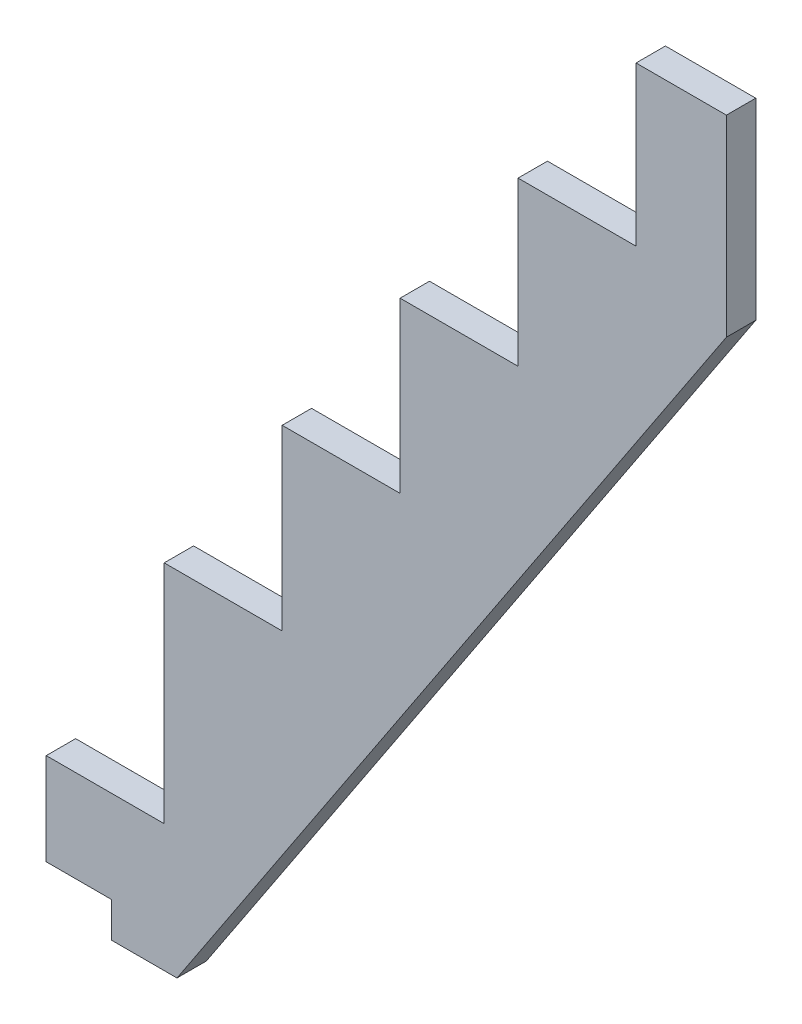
ISO-10303-21;
HEADER;
FILE_DESCRIPTION(('STEP AP214'),'2;1');
FILE_NAME('part.step','',(''),(''),'','','');
FILE_SCHEMA(('AUTOMOTIVE_DESIGN { 1 0 10303 214 1 1 1 1 }'));
ENDSEC;
DATA;
#1=APPLICATION_CONTEXT('core data for automotive mechanical design processes');
#2=APPLICATION_PROTOCOL_DEFINITION('international standard','automotive_design',2000,#1);
#3=PRODUCT_CONTEXT('',#1,'mechanical');
#4=PRODUCT('Part','Part','',(#3));
#5=PRODUCT_RELATED_PRODUCT_CATEGORY('part','',(#4));
#6=PRODUCT_DEFINITION_FORMATION('','',#4);
#7=PRODUCT_DEFINITION_CONTEXT('part definition',#1,'design');
#8=PRODUCT_DEFINITION('design','',#6,#7);
#9=PRODUCT_DEFINITION_SHAPE('','',#8);
#10=(LENGTH_UNIT() NAMED_UNIT(*) SI_UNIT(.MILLI.,.METRE.));
#11=(NAMED_UNIT(*) PLANE_ANGLE_UNIT() SI_UNIT($,.RADIAN.));
#12=(NAMED_UNIT(*) SI_UNIT($,.STERADIAN.) SOLID_ANGLE_UNIT());
#13=UNCERTAINTY_MEASURE_WITH_UNIT(LENGTH_MEASURE(1.E-05),#10,'distance_accuracy_value','');
#14=(GEOMETRIC_REPRESENTATION_CONTEXT(3) GLOBAL_UNCERTAINTY_ASSIGNED_CONTEXT((#13)) GLOBAL_UNIT_ASSIGNED_CONTEXT((#10,
#11,#12)) REPRESENTATION_CONTEXT('',''));
#15=CARTESIAN_POINT('',(0.,0.,0.));
#16=DIRECTION('',(0.,0.,1.));
#17=DIRECTION('',(1.,0.,0.));
#18=AXIS2_PLACEMENT_3D('',#15,#16,#17);
#19=CARTESIAN_POINT('',(-501.90700356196,-2579.9725408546,50.));
#20=DIRECTION('',(0.,1.,0.));
#21=DIRECTION('',(0.,0.,1.));
#22=AXIS2_PLACEMENT_3D('',#19,#20,#21);
#23=PLANE('',#22);
#24=DIRECTION('',(1.,0.,0.));
#25=VECTOR('',#24,1.);
#26=CARTESIAN_POINT('',(-501.90700356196,-2579.9725408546,0.));
#27=LINE('',#26,#25);
#28=CARTESIAN_POINT('',(-613.412502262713,-2579.9725408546,0.));
#29=VERTEX_POINT('',#28);
#30=CARTESIAN_POINT('',(-501.90700356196,-2579.9725408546,0.));
#31=VERTEX_POINT('',#30);
#32=EDGE_CURVE('E152',#29,#31,#27,.T.);
#33=ORIENTED_EDGE('',*,*,#32,.T.);
#34=DIRECTION('',(0.,0.,-1.));
#35=VECTOR('',#34,1.);
#36=CARTESIAN_POINT('',(-501.90700356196,-2579.9725408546,50.));
#37=LINE('',#36,#35);
#38=CARTESIAN_POINT('',(-501.90700356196,-2579.9725408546,50.));
#39=VERTEX_POINT('',#38);
#40=EDGE_CURVE('E11',#39,#31,#37,.T.);
#41=ORIENTED_EDGE('',*,*,#40,.F.);
#42=DIRECTION('',(1.,0.,0.));
#43=VECTOR('',#42,1.);
#44=CARTESIAN_POINT('',(-501.90700356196,-2579.9725408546,50.));
#45=LINE('',#44,#43);
#46=CARTESIAN_POINT('',(-613.412502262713,-2579.9725408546,50.));
#47=VERTEX_POINT('',#46);
#48=EDGE_CURVE('E197',#47,#39,#45,.T.);
#49=ORIENTED_EDGE('',*,*,#48,.F.);
#50=DIRECTION('',(0.,0.,-1.));
#51=VECTOR('',#50,1.);
#52=CARTESIAN_POINT('',(-613.412502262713,-2579.9725408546,50.));
#53=LINE('',#52,#51);
#54=EDGE_CURVE('E165',#47,#29,#53,.T.);
#55=ORIENTED_EDGE('',*,*,#54,.T.);
#56=EDGE_LOOP('',(#33,#41,#49,#55));
#57=FACE_BOUND('',#56,.T.);
#58=ADVANCED_FACE('F30',(#57),#23,.F.);
#59=CARTESIAN_POINT('',(-501.90700356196,-2579.9725408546,50.));
#60=DIRECTION('',(-0.833749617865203,0.552142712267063,0.));
#61=DIRECTION('',(-0.552142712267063,-0.833749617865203,0.));
#62=AXIS2_PLACEMENT_3D('',#59,#60,#61);
#63=PLANE('',#62);
#64=DIRECTION('',(0.552142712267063,0.833749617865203,0.));
#65=VECTOR('',#64,1.);
#66=CARTESIAN_POINT('',(-501.90700356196,-2579.9725408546,0.));
#67=LINE('',#66,#65);
#68=CARTESIAN_POINT('',(433.207497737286,-1167.9257261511,0.));
#69=VERTEX_POINT('',#68);
#70=EDGE_CURVE('E148',#31,#69,#67,.T.);
#71=ORIENTED_EDGE('',*,*,#70,.T.);
#72=DIRECTION('',(0.,0.,-1.));
#73=VECTOR('',#72,1.);
#74=CARTESIAN_POINT('',(433.207497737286,-1167.9257261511,50.));
#75=LINE('',#74,#73);
#76=CARTESIAN_POINT('',(433.207497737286,-1167.9257261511,50.));
#77=VERTEX_POINT('',#76);
#78=EDGE_CURVE('E37',#77,#69,#75,.T.);
#79=ORIENTED_EDGE('',*,*,#78,.F.);
#80=DIRECTION('',(0.552142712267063,0.833749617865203,0.));
#81=VECTOR('',#80,1.);
#82=CARTESIAN_POINT('',(-501.90700356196,-2579.9725408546,50.));
#83=LINE('',#82,#81);
#84=EDGE_CURVE('E161',#39,#77,#83,.T.);
#85=ORIENTED_EDGE('',*,*,#84,.F.);
#86=ORIENTED_EDGE('',*,*,#40,.T.);
#87=EDGE_LOOP('',(#71,#79,#85,#86));
#88=FACE_BOUND('',#87,.T.);
#89=ADVANCED_FACE('F160',(#88),#63,.F.);
#90=CARTESIAN_POINT('',(433.207497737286,-840.511783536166,50.));
#91=DIRECTION('',(-1.,0.,0.));
#92=DIRECTION('',(0.,-1.,0.));
#93=AXIS2_PLACEMENT_3D('',#90,#91,#92);
#94=PLANE('',#93);
#95=DIRECTION('',(0.,1.,0.));
#96=VECTOR('',#95,1.);
#97=CARTESIAN_POINT('',(433.207497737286,-840.511783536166,0.));
#98=LINE('',#97,#96);
#99=CARTESIAN_POINT('',(433.207497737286,-840.511783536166,0.));
#100=VERTEX_POINT('',#99);
#101=EDGE_CURVE('E154',#69,#100,#98,.T.);
#102=ORIENTED_EDGE('',*,*,#101,.T.);
#103=DIRECTION('',(0.,0.,-1.));
#104=VECTOR('',#103,1.);
#105=CARTESIAN_POINT('',(433.207497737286,-840.511783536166,50.));
#106=LINE('',#105,#104);
#107=CARTESIAN_POINT('',(433.207497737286,-840.511783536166,50.));
#108=VERTEX_POINT('',#107);
#109=EDGE_CURVE('E268',#108,#100,#106,.T.);
#110=ORIENTED_EDGE('',*,*,#109,.F.);
#111=DIRECTION('',(0.,1.,0.));
#112=VECTOR('',#111,1.);
#113=CARTESIAN_POINT('',(433.207497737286,-840.511783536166,50.));
#114=LINE('',#113,#112);
#115=EDGE_CURVE('E200',#77,#108,#114,.T.);
#116=ORIENTED_EDGE('',*,*,#115,.F.);
#117=ORIENTED_EDGE('',*,*,#78,.T.);
#118=EDGE_LOOP('',(#102,#110,#116,#117));
#119=FACE_BOUND('',#118,.T.);
#120=ADVANCED_FACE('F272',(#119),#94,.F.);
#121=CARTESIAN_POINT('',(279.437497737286,-840.511783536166,50.));
#122=DIRECTION('',(0.,-1.,0.));
#123=DIRECTION('',(0.,0.,-1.));
#124=AXIS2_PLACEMENT_3D('',#121,#122,#123);
#125=PLANE('',#124);
#126=DIRECTION('',(-1.,0.,0.));
#127=VECTOR('',#126,1.);
#128=CARTESIAN_POINT('',(279.437497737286,-840.511783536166,0.));
#129=LINE('',#128,#127);
#130=CARTESIAN_POINT('',(279.437497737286,-840.511783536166,0.));
#131=VERTEX_POINT('',#130);
#132=EDGE_CURVE('E169',#100,#131,#129,.T.);
#133=ORIENTED_EDGE('',*,*,#132,.T.);
#134=DIRECTION('',(0.,0.,-1.));
#135=VECTOR('',#134,1.);
#136=CARTESIAN_POINT('',(279.437497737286,-840.511783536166,50.));
#137=LINE('',#136,#135);
#138=CARTESIAN_POINT('',(279.437497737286,-840.511783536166,50.));
#139=VERTEX_POINT('',#138);
#140=EDGE_CURVE('E265',#139,#131,#137,.T.);
#141=ORIENTED_EDGE('',*,*,#140,.F.);
#142=DIRECTION('',(-1.,0.,0.));
#143=VECTOR('',#142,1.);
#144=CARTESIAN_POINT('',(279.437497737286,-840.511783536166,50.));
#145=LINE('',#144,#143);
#146=EDGE_CURVE('E202',#108,#139,#145,.T.);
#147=ORIENTED_EDGE('',*,*,#146,.F.);
#148=ORIENTED_EDGE('',*,*,#109,.T.);
#149=EDGE_LOOP('',(#133,#141,#147,#148));
#150=FACE_BOUND('',#149,.T.);
#151=ADVANCED_FACE('F280',(#150),#125,.F.);
#152=CARTESIAN_POINT('',(279.437497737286,-1110.57926459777,50.));
#153=DIRECTION('',(1.,0.,0.));
#154=DIRECTION('',(0.,0.,-1.));
#155=AXIS2_PLACEMENT_3D('',#152,#153,#154);
#156=PLANE('',#155);
#157=DIRECTION('',(0.,-1.,0.));
#158=VECTOR('',#157,1.);
#159=CARTESIAN_POINT('',(279.437497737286,-1110.57926459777,0.));
#160=LINE('',#159,#158);
#161=CARTESIAN_POINT('',(279.437497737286,-1110.57926459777,0.));
#162=VERTEX_POINT('',#161);
#163=EDGE_CURVE('E171',#131,#162,#160,.T.);
#164=ORIENTED_EDGE('',*,*,#163,.T.);
#165=DIRECTION('',(0.,0.,-1.));
#166=VECTOR('',#165,1.);
#167=CARTESIAN_POINT('',(279.437497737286,-1110.57926459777,50.));
#168=LINE('',#167,#166);
#169=CARTESIAN_POINT('',(279.437497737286,-1110.57926459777,50.));
#170=VERTEX_POINT('',#169);
#171=EDGE_CURVE('E262',#170,#162,#168,.T.);
#172=ORIENTED_EDGE('',*,*,#171,.F.);
#173=DIRECTION('',(0.,-1.,0.));
#174=VECTOR('',#173,1.);
#175=CARTESIAN_POINT('',(279.437497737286,-1110.57926459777,50.));
#176=LINE('',#175,#174);
#177=EDGE_CURVE('E204',#139,#170,#176,.T.);
#178=ORIENTED_EDGE('',*,*,#177,.F.);
#179=ORIENTED_EDGE('',*,*,#140,.T.);
#180=EDGE_LOOP('',(#164,#172,#178,#179));
#181=FACE_BOUND('',#180,.T.);
#182=ADVANCED_FACE('F283',(#181),#156,.F.);
#183=CARTESIAN_POINT('',(78.667497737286,-1110.57926459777,50.));
#184=DIRECTION('',(0.,-1.,0.));
#185=DIRECTION('',(0.,0.,-1.));
#186=AXIS2_PLACEMENT_3D('',#183,#184,#185);
#187=PLANE('',#186);
#188=DIRECTION('',(-1.,0.,0.));
#189=VECTOR('',#188,1.);
#190=CARTESIAN_POINT('',(78.667497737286,-1110.57926459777,0.));
#191=LINE('',#190,#189);
#192=CARTESIAN_POINT('',(78.667497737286,-1110.57926459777,0.));
#193=VERTEX_POINT('',#192);
#194=EDGE_CURVE('E173',#162,#193,#191,.T.);
#195=ORIENTED_EDGE('',*,*,#194,.T.);
#196=DIRECTION('',(0.,0.,-1.));
#197=VECTOR('',#196,1.);
#198=CARTESIAN_POINT('',(78.667497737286,-1110.57926459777,50.));
#199=LINE('',#198,#197);
#200=CARTESIAN_POINT('',(78.667497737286,-1110.57926459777,50.));
#201=VERTEX_POINT('',#200);
#202=EDGE_CURVE('E259',#201,#193,#199,.T.);
#203=ORIENTED_EDGE('',*,*,#202,.F.);
#204=DIRECTION('',(-1.,0.,0.));
#205=VECTOR('',#204,1.);
#206=CARTESIAN_POINT('',(78.667497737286,-1110.57926459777,50.));
#207=LINE('',#206,#205);
#208=EDGE_CURVE('E206',#170,#201,#207,.T.);
#209=ORIENTED_EDGE('',*,*,#208,.F.);
#210=ORIENTED_EDGE('',*,*,#171,.T.);
#211=EDGE_LOOP('',(#195,#203,#209,#210));
#212=FACE_BOUND('',#211,.T.);
#213=ADVANCED_FACE('F288',(#212),#187,.F.);
#214=CARTESIAN_POINT('',(78.667497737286,-1387.99304010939,50.));
#215=DIRECTION('',(1.,0.,0.));
#216=DIRECTION('',(0.,0.,-1.));
#217=AXIS2_PLACEMENT_3D('',#214,#215,#216);
#218=PLANE('',#217);
#219=DIRECTION('',(0.,-1.,0.));
#220=VECTOR('',#219,1.);
#221=CARTESIAN_POINT('',(78.667497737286,-1387.99304010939,0.));
#222=LINE('',#221,#220);
#223=CARTESIAN_POINT('',(78.667497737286,-1387.99304010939,0.));
#224=VERTEX_POINT('',#223);
#225=EDGE_CURVE('E175',#193,#224,#222,.T.);
#226=ORIENTED_EDGE('',*,*,#225,.T.);
#227=DIRECTION('',(0.,0.,-1.));
#228=VECTOR('',#227,1.);
#229=CARTESIAN_POINT('',(78.667497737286,-1387.99304010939,50.));
#230=LINE('',#229,#228);
#231=CARTESIAN_POINT('',(78.667497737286,-1387.99304010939,50.));
#232=VERTEX_POINT('',#231);
#233=EDGE_CURVE('E256',#232,#224,#230,.T.);
#234=ORIENTED_EDGE('',*,*,#233,.F.);
#235=DIRECTION('',(0.,-1.,0.));
#236=VECTOR('',#235,1.);
#237=CARTESIAN_POINT('',(78.667497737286,-1387.99304010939,50.));
#238=LINE('',#237,#236);
#239=EDGE_CURVE('E208',#201,#232,#238,.T.);
#240=ORIENTED_EDGE('',*,*,#239,.F.);
#241=ORIENTED_EDGE('',*,*,#202,.T.);
#242=EDGE_LOOP('',(#226,#234,#240,#241));
#243=FACE_BOUND('',#242,.T.);
#244=ADVANCED_FACE('F294',(#243),#218,.F.);
#245=CARTESIAN_POINT('',(-122.102502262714,-1387.99304010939,50.));
#246=DIRECTION('',(0.,-1.,0.));
#247=DIRECTION('',(0.,0.,-1.));
#248=AXIS2_PLACEMENT_3D('',#245,#246,#247);
#249=PLANE('',#248);
#250=DIRECTION('',(-1.,0.,0.));
#251=VECTOR('',#250,1.);
#252=CARTESIAN_POINT('',(-122.102502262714,-1387.99304010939,0.));
#253=LINE('',#252,#251);
#254=CARTESIAN_POINT('',(-122.102502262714,-1387.99304010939,0.));
#255=VERTEX_POINT('',#254);
#256=EDGE_CURVE('E177',#224,#255,#253,.T.);
#257=ORIENTED_EDGE('',*,*,#256,.T.);
#258=DIRECTION('',(0.,0.,-1.));
#259=VECTOR('',#258,1.);
#260=CARTESIAN_POINT('',(-122.102502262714,-1387.99304010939,50.));
#261=LINE('',#260,#259);
#262=CARTESIAN_POINT('',(-122.102502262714,-1387.99304010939,50.));
#263=VERTEX_POINT('',#262);
#264=EDGE_CURVE('E253',#263,#255,#261,.T.);
#265=ORIENTED_EDGE('',*,*,#264,.F.);
#266=DIRECTION('',(-1.,0.,0.));
#267=VECTOR('',#266,1.);
#268=CARTESIAN_POINT('',(-122.102502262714,-1387.99304010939,50.));
#269=LINE('',#268,#267);
#270=EDGE_CURVE('E210',#232,#263,#269,.T.);
#271=ORIENTED_EDGE('',*,*,#270,.F.);
#272=ORIENTED_EDGE('',*,*,#233,.T.);
#273=EDGE_LOOP('',(#257,#265,#271,#272));
#274=FACE_BOUND('',#273,.T.);
#275=ADVANCED_FACE('F298',(#274),#249,.F.);
#276=CARTESIAN_POINT('',(-122.102502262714,-1675.73177854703,50.));
#277=DIRECTION('',(1.,0.,0.));
#278=DIRECTION('',(0.,0.,-1.));
#279=AXIS2_PLACEMENT_3D('',#276,#277,#278);
#280=PLANE('',#279);
#281=DIRECTION('',(0.,-1.,0.));
#282=VECTOR('',#281,1.);
#283=CARTESIAN_POINT('',(-122.102502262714,-1675.73177854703,0.));
#284=LINE('',#283,#282);
#285=CARTESIAN_POINT('',(-122.102502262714,-1675.73177854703,0.));
#286=VERTEX_POINT('',#285);
#287=EDGE_CURVE('E179',#255,#286,#284,.T.);
#288=ORIENTED_EDGE('',*,*,#287,.T.);
#289=DIRECTION('',(0.,0.,-1.));
#290=VECTOR('',#289,1.);
#291=CARTESIAN_POINT('',(-122.102502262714,-1675.73177854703,50.));
#292=LINE('',#291,#290);
#293=CARTESIAN_POINT('',(-122.102502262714,-1675.73177854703,50.));
#294=VERTEX_POINT('',#293);
#295=EDGE_CURVE('E250',#294,#286,#292,.T.);
#296=ORIENTED_EDGE('',*,*,#295,.F.);
#297=DIRECTION('',(0.,-1.,0.));
#298=VECTOR('',#297,1.);
#299=CARTESIAN_POINT('',(-122.102502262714,-1675.73177854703,50.));
#300=LINE('',#299,#298);
#301=EDGE_CURVE('E212',#263,#294,#300,.T.);
#302=ORIENTED_EDGE('',*,*,#301,.F.);
#303=ORIENTED_EDGE('',*,*,#264,.T.);
#304=EDGE_LOOP('',(#288,#296,#302,#303));
#305=FACE_BOUND('',#304,.T.);
#306=ADVANCED_FACE('F303',(#305),#280,.F.);
#307=CARTESIAN_POINT('',(-322.872502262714,-1675.73177854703,50.));
#308=DIRECTION('',(0.,-1.,0.));
#309=DIRECTION('',(0.,0.,-1.));
#310=AXIS2_PLACEMENT_3D('',#307,#308,#309);
#311=PLANE('',#310);
#312=DIRECTION('',(-1.,0.,0.));
#313=VECTOR('',#312,1.);
#314=CARTESIAN_POINT('',(-322.872502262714,-1675.73177854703,0.));
#315=LINE('',#314,#313);
#316=CARTESIAN_POINT('',(-322.872502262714,-1675.73177854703,0.));
#317=VERTEX_POINT('',#316);
#318=EDGE_CURVE('E181',#286,#317,#315,.T.);
#319=ORIENTED_EDGE('',*,*,#318,.T.);
#320=DIRECTION('',(0.,0.,-1.));
#321=VECTOR('',#320,1.);
#322=CARTESIAN_POINT('',(-322.872502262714,-1675.73177854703,50.));
#323=LINE('',#322,#321);
#324=CARTESIAN_POINT('',(-322.872502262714,-1675.73177854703,50.));
#325=VERTEX_POINT('',#324);
#326=EDGE_CURVE('E247',#325,#317,#323,.T.);
#327=ORIENTED_EDGE('',*,*,#326,.F.);
#328=DIRECTION('',(-1.,0.,0.));
#329=VECTOR('',#328,1.);
#330=CARTESIAN_POINT('',(-322.872502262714,-1675.73177854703,50.));
#331=LINE('',#330,#329);
#332=EDGE_CURVE('E214',#294,#325,#331,.T.);
#333=ORIENTED_EDGE('',*,*,#332,.F.);
#334=ORIENTED_EDGE('',*,*,#295,.T.);
#335=EDGE_LOOP('',(#319,#327,#333,#334));
#336=FACE_BOUND('',#335,.T.);
#337=ADVANCED_FACE('F309',(#336),#311,.F.);
#338=CARTESIAN_POINT('',(-322.872502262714,-1978.89961370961,50.));
#339=DIRECTION('',(1.,0.,0.));
#340=DIRECTION('',(0.,0.,-1.));
#341=AXIS2_PLACEMENT_3D('',#338,#339,#340);
#342=PLANE('',#341);
#343=DIRECTION('',(0.,-1.,0.));
#344=VECTOR('',#343,1.);
#345=CARTESIAN_POINT('',(-322.872502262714,-1978.89961370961,0.));
#346=LINE('',#345,#344);
#347=CARTESIAN_POINT('',(-322.872502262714,-1978.89961370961,0.));
#348=VERTEX_POINT('',#347);
#349=EDGE_CURVE('E183',#317,#348,#346,.T.);
#350=ORIENTED_EDGE('',*,*,#349,.T.);
#351=DIRECTION('',(0.,0.,-1.));
#352=VECTOR('',#351,1.);
#353=CARTESIAN_POINT('',(-322.872502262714,-1978.89961370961,50.));
#354=LINE('',#353,#352);
#355=CARTESIAN_POINT('',(-322.872502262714,-1978.89961370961,50.));
#356=VERTEX_POINT('',#355);
#357=EDGE_CURVE('E244',#356,#348,#354,.T.);
#358=ORIENTED_EDGE('',*,*,#357,.F.);
#359=DIRECTION('',(0.,-1.,0.));
#360=VECTOR('',#359,1.);
#361=CARTESIAN_POINT('',(-322.872502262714,-1978.89961370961,50.));
#362=LINE('',#361,#360);
#363=EDGE_CURVE('E216',#325,#356,#362,.T.);
#364=ORIENTED_EDGE('',*,*,#363,.F.);
#365=ORIENTED_EDGE('',*,*,#326,.T.);
#366=EDGE_LOOP('',(#350,#358,#364,#365));
#367=FACE_BOUND('',#366,.T.);
#368=ADVANCED_FACE('F313',(#367),#342,.F.);
#369=CARTESIAN_POINT('',(-523.642502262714,-1978.89961370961,50.));
#370=DIRECTION('',(0.,-1.,0.));
#371=DIRECTION('',(0.,0.,-1.));
#372=AXIS2_PLACEMENT_3D('',#369,#370,#371);
#373=PLANE('',#372);
#374=DIRECTION('',(-1.,0.,0.));
#375=VECTOR('',#374,1.);
#376=CARTESIAN_POINT('',(-523.642502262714,-1978.89961370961,0.));
#377=LINE('',#376,#375);
#378=CARTESIAN_POINT('',(-523.642502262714,-1978.89961370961,0.));
#379=VERTEX_POINT('',#378);
#380=EDGE_CURVE('E185',#348,#379,#377,.T.);
#381=ORIENTED_EDGE('',*,*,#380,.T.);
#382=DIRECTION('',(0.,0.,-1.));
#383=VECTOR('',#382,1.);
#384=CARTESIAN_POINT('',(-523.642502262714,-1978.89961370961,50.));
#385=LINE('',#384,#383);
#386=CARTESIAN_POINT('',(-523.642502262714,-1978.89961370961,50.));
#387=VERTEX_POINT('',#386);
#388=EDGE_CURVE('E241',#387,#379,#385,.T.);
#389=ORIENTED_EDGE('',*,*,#388,.F.);
#390=DIRECTION('',(-1.,0.,0.));
#391=VECTOR('',#390,1.);
#392=CARTESIAN_POINT('',(-523.642502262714,-1978.89961370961,50.));
#393=LINE('',#392,#391);
#394=EDGE_CURVE('E218',#356,#387,#393,.T.);
#395=ORIENTED_EDGE('',*,*,#394,.F.);
#396=ORIENTED_EDGE('',*,*,#357,.T.);
#397=EDGE_LOOP('',(#381,#389,#395,#396));
#398=FACE_BOUND('',#397,.T.);
#399=ADVANCED_FACE('F318',(#398),#373,.F.);
#400=CARTESIAN_POINT('',(-523.642502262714,-2363.39379994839,50.));
#401=DIRECTION('',(1.,0.,0.));
#402=DIRECTION('',(0.,0.,-1.));
#403=AXIS2_PLACEMENT_3D('',#400,#401,#402);
#404=PLANE('',#403);
#405=DIRECTION('',(0.,-1.,0.));
#406=VECTOR('',#405,1.);
#407=CARTESIAN_POINT('',(-523.642502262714,-2363.39379994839,0.));
#408=LINE('',#407,#406);
#409=CARTESIAN_POINT('',(-523.642502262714,-2363.39379994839,0.));
#410=VERTEX_POINT('',#409);
#411=EDGE_CURVE('E187',#379,#410,#408,.T.);
#412=ORIENTED_EDGE('',*,*,#411,.T.);
#413=DIRECTION('',(0.,0.,-1.));
#414=VECTOR('',#413,1.);
#415=CARTESIAN_POINT('',(-523.642502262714,-2363.39379994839,50.));
#416=LINE('',#415,#414);
#417=CARTESIAN_POINT('',(-523.642502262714,-2363.39379994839,50.));
#418=VERTEX_POINT('',#417);
#419=EDGE_CURVE('E238',#418,#410,#416,.T.);
#420=ORIENTED_EDGE('',*,*,#419,.F.);
#421=DIRECTION('',(0.,-1.,0.));
#422=VECTOR('',#421,1.);
#423=CARTESIAN_POINT('',(-523.642502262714,-2363.39379994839,50.));
#424=LINE('',#423,#422);
#425=EDGE_CURVE('E220',#387,#418,#424,.T.);
#426=ORIENTED_EDGE('',*,*,#425,.F.);
#427=ORIENTED_EDGE('',*,*,#388,.T.);
#428=EDGE_LOOP('',(#412,#420,#426,#427));
#429=FACE_BOUND('',#428,.T.);
#430=ADVANCED_FACE('F324',(#429),#404,.F.);
#431=CARTESIAN_POINT('',(-724.412502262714,-2363.39379994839,50.));
#432=DIRECTION('',(0.,-1.,0.));
#433=DIRECTION('',(0.,0.,-1.));
#434=AXIS2_PLACEMENT_3D('',#431,#432,#433);
#435=PLANE('',#434);
#436=DIRECTION('',(-1.,0.,0.));
#437=VECTOR('',#436,1.);
#438=CARTESIAN_POINT('',(-724.412502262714,-2363.39379994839,0.));
#439=LINE('',#438,#437);
#440=CARTESIAN_POINT('',(-724.412502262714,-2363.39379994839,0.));
#441=VERTEX_POINT('',#440);
#442=EDGE_CURVE('E189',#410,#441,#439,.T.);
#443=ORIENTED_EDGE('',*,*,#442,.T.);
#444=DIRECTION('',(0.,0.,-1.));
#445=VECTOR('',#444,1.);
#446=CARTESIAN_POINT('',(-724.412502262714,-2363.39379994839,50.));
#447=LINE('',#446,#445);
#448=CARTESIAN_POINT('',(-724.412502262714,-2363.39379994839,50.));
#449=VERTEX_POINT('',#448);
#450=EDGE_CURVE('E235',#449,#441,#447,.T.);
#451=ORIENTED_EDGE('',*,*,#450,.F.);
#452=DIRECTION('',(-1.,0.,0.));
#453=VECTOR('',#452,1.);
#454=CARTESIAN_POINT('',(-724.412502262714,-2363.39379994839,50.));
#455=LINE('',#454,#453);
#456=EDGE_CURVE('E222',#418,#449,#455,.T.);
#457=ORIENTED_EDGE('',*,*,#456,.F.);
#458=ORIENTED_EDGE('',*,*,#419,.T.);
#459=EDGE_LOOP('',(#443,#451,#457,#458));
#460=FACE_BOUND('',#459,.T.);
#461=ADVANCED_FACE('F328',(#460),#435,.F.);
#462=CARTESIAN_POINT('',(-724.412502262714,-2363.39379994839,50.));
#463=DIRECTION('',(1.,0.,0.));
#464=DIRECTION('',(0.,1.,0.));
#465=AXIS2_PLACEMENT_3D('',#462,#463,#464);
#466=PLANE('',#465);
#467=DIRECTION('',(0.,-1.,0.));
#468=VECTOR('',#467,1.);
#469=CARTESIAN_POINT('',(-724.412502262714,-2363.39379994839,0.));
#470=LINE('',#469,#468);
#471=CARTESIAN_POINT('',(-724.412502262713,-2519.9725408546,0.));
#472=VERTEX_POINT('',#471);
#473=EDGE_CURVE('E191',#441,#472,#470,.T.);
#474=ORIENTED_EDGE('',*,*,#473,.T.);
#475=DIRECTION('',(0.,0.,-1.));
#476=VECTOR('',#475,1.);
#477=CARTESIAN_POINT('',(-724.412502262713,-2519.9725408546,50.));
#478=LINE('',#477,#476);
#479=CARTESIAN_POINT('',(-724.412502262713,-2519.9725408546,50.));
#480=VERTEX_POINT('',#479);
#481=EDGE_CURVE('E232',#480,#472,#478,.T.);
#482=ORIENTED_EDGE('',*,*,#481,.F.);
#483=DIRECTION('',(0.,-1.,0.));
#484=VECTOR('',#483,1.);
#485=CARTESIAN_POINT('',(-724.412502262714,-2363.39379994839,50.));
#486=LINE('',#485,#484);
#487=EDGE_CURVE('E224',#449,#480,#486,.T.);
#488=ORIENTED_EDGE('',*,*,#487,.F.);
#489=ORIENTED_EDGE('',*,*,#450,.T.);
#490=EDGE_LOOP('',(#474,#482,#488,#489));
#491=FACE_BOUND('',#490,.T.);
#492=ADVANCED_FACE('F333',(#491),#466,.F.);
#493=CARTESIAN_POINT('',(-724.412502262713,-2519.9725408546,50.));
#494=DIRECTION('',(0.,1.,0.));
#495=DIRECTION('',(0.,0.,1.));
#496=AXIS2_PLACEMENT_3D('',#493,#494,#495);
#497=PLANE('',#496);
#498=DIRECTION('',(1.,0.,0.));
#499=VECTOR('',#498,1.);
#500=CARTESIAN_POINT('',(-724.412502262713,-2519.9725408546,0.));
#501=LINE('',#500,#499);
#502=CARTESIAN_POINT('',(-613.412502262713,-2519.9725408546,0.));
#503=VERTEX_POINT('',#502);
#504=EDGE_CURVE('E193',#472,#503,#501,.T.);
#505=ORIENTED_EDGE('',*,*,#504,.T.);
#506=DIRECTION('',(0.,0.,-1.));
#507=VECTOR('',#506,1.);
#508=CARTESIAN_POINT('',(-613.412502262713,-2519.9725408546,50.));
#509=LINE('',#508,#507);
#510=CARTESIAN_POINT('',(-613.412502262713,-2519.9725408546,50.));
#511=VERTEX_POINT('',#510);
#512=EDGE_CURVE('E229',#511,#503,#509,.T.);
#513=ORIENTED_EDGE('',*,*,#512,.F.);
#514=DIRECTION('',(1.,0.,0.));
#515=VECTOR('',#514,1.);
#516=CARTESIAN_POINT('',(-724.412502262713,-2519.9725408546,50.));
#517=LINE('',#516,#515);
#518=EDGE_CURVE('E49',#480,#511,#517,.T.);
#519=ORIENTED_EDGE('',*,*,#518,.F.);
#520=ORIENTED_EDGE('',*,*,#481,.T.);
#521=EDGE_LOOP('',(#505,#513,#519,#520));
#522=FACE_BOUND('',#521,.T.);
#523=ADVANCED_FACE('F336',(#522),#497,.F.);
#524=CARTESIAN_POINT('',(-613.412502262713,-2519.9725408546,50.));
#525=DIRECTION('',(1.,0.,0.));
#526=DIRECTION('',(0.,0.,-1.));
#527=AXIS2_PLACEMENT_3D('',#524,#525,#526);
#528=PLANE('',#527);
#529=DIRECTION('',(0.,-1.,0.));
#530=VECTOR('',#529,1.);
#531=CARTESIAN_POINT('',(-613.412502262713,-2519.9725408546,0.));
#532=LINE('',#531,#530);
#533=EDGE_CURVE('E195',#503,#29,#532,.T.);
#534=ORIENTED_EDGE('',*,*,#533,.T.);
#535=ORIENTED_EDGE('',*,*,#54,.F.);
#536=DIRECTION('',(0.,-1.,0.));
#537=VECTOR('',#536,1.);
#538=CARTESIAN_POINT('',(-613.412502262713,-2519.9725408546,50.));
#539=LINE('',#538,#537);
#540=EDGE_CURVE('E44',#511,#47,#539,.T.);
#541=ORIENTED_EDGE('',*,*,#540,.F.);
#542=ORIENTED_EDGE('',*,*,#512,.T.);
#543=EDGE_LOOP('',(#534,#535,#541,#542));
#544=FACE_BOUND('',#543,.T.);
#545=ADVANCED_FACE('F338',(#544),#528,.F.);
#546=CARTESIAN_POINT('',(-613.412502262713,-2579.9725408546,50.));
#547=DIRECTION('',(0.,0.,1.));
#548=DIRECTION('',(1.,0.,0.));
#549=AXIS2_PLACEMENT_3D('',#546,#547,#548);
#550=PLANE('',#549);
#551=ORIENTED_EDGE('',*,*,#48,.T.);
#552=ORIENTED_EDGE('',*,*,#84,.T.);
#553=ORIENTED_EDGE('',*,*,#115,.T.);
#554=ORIENTED_EDGE('',*,*,#146,.T.);
#555=ORIENTED_EDGE('',*,*,#177,.T.);
#556=ORIENTED_EDGE('',*,*,#208,.T.);
#557=ORIENTED_EDGE('',*,*,#239,.T.);
#558=ORIENTED_EDGE('',*,*,#270,.T.);
#559=ORIENTED_EDGE('',*,*,#301,.T.);
#560=ORIENTED_EDGE('',*,*,#332,.T.);
#561=ORIENTED_EDGE('',*,*,#363,.T.);
#562=ORIENTED_EDGE('',*,*,#394,.T.);
#563=ORIENTED_EDGE('',*,*,#425,.T.);
#564=ORIENTED_EDGE('',*,*,#456,.T.);
#565=ORIENTED_EDGE('',*,*,#487,.T.);
#566=ORIENTED_EDGE('',*,*,#518,.T.);
#567=ORIENTED_EDGE('',*,*,#540,.T.);
#568=EDGE_LOOP('',(#551,#552,#553,#554,#555,#556,#557,#558,#559,#560,#561,#562,#563,#564,#565,
#566,#567));
#569=FACE_BOUND('',#568,.T.);
#570=ADVANCED_FACE('F275',(#569),#550,.T.);
#571=CARTESIAN_POINT('',(-613.412502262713,-2579.9725408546,0.));
#572=DIRECTION('',(0.,0.,1.));
#573=DIRECTION('',(1.,0.,0.));
#574=AXIS2_PLACEMENT_3D('',#571,#572,#573);
#575=PLANE('',#574);
#576=ORIENTED_EDGE('',*,*,#32,.F.);
#577=ORIENTED_EDGE('',*,*,#533,.F.);
#578=ORIENTED_EDGE('',*,*,#504,.F.);
#579=ORIENTED_EDGE('',*,*,#473,.F.);
#580=ORIENTED_EDGE('',*,*,#442,.F.);
#581=ORIENTED_EDGE('',*,*,#411,.F.);
#582=ORIENTED_EDGE('',*,*,#380,.F.);
#583=ORIENTED_EDGE('',*,*,#349,.F.);
#584=ORIENTED_EDGE('',*,*,#318,.F.);
#585=ORIENTED_EDGE('',*,*,#287,.F.);
#586=ORIENTED_EDGE('',*,*,#256,.F.);
#587=ORIENTED_EDGE('',*,*,#225,.F.);
#588=ORIENTED_EDGE('',*,*,#194,.F.);
#589=ORIENTED_EDGE('',*,*,#163,.F.);
#590=ORIENTED_EDGE('',*,*,#132,.F.);
#591=ORIENTED_EDGE('',*,*,#101,.F.);
#592=ORIENTED_EDGE('',*,*,#70,.F.);
#593=EDGE_LOOP('',(#576,#577,#578,#579,#580,#581,#582,#583,#584,#585,#586,#587,#588,#589,#590,
#591,#592));
#594=FACE_BOUND('',#593,.T.);
#595=ADVANCED_FACE('F149',(#594),#575,.F.);
#596=CLOSED_SHELL('',(#58,#89,#120,#151,#182,#213,#244,#275,#306,#337,#368,#399,#430,#461,#492,
#523,#545,#570,#595));
#597=MANIFOLD_SOLID_BREP('B2',#596);
#598=ADVANCED_BREP_SHAPE_REPRESENTATION('',(#18,#597),#14);
#599=SHAPE_DEFINITION_REPRESENTATION(#9,#598);
ENDSEC;
END-ISO-10303-21;
